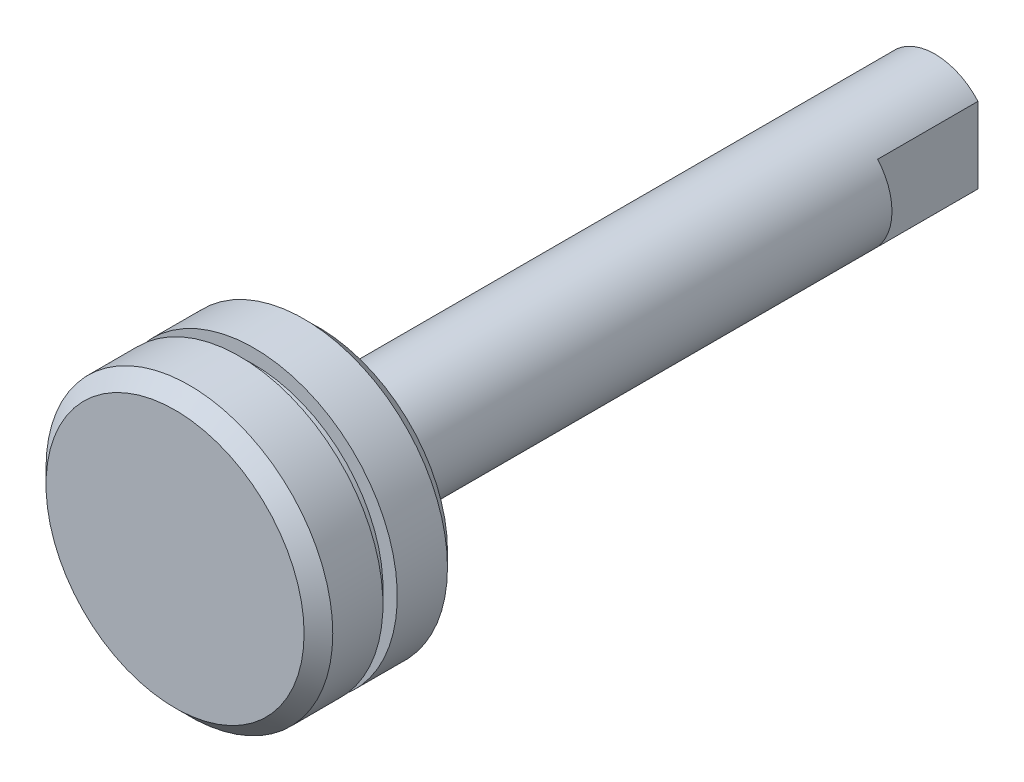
ISO-10303-21;
HEADER;
FILE_DESCRIPTION(('STEP AP214'),'2;1');
FILE_NAME('part.step','',(''),(''),'','','');
FILE_SCHEMA(('AUTOMOTIVE_DESIGN { 1 0 10303 214 1 1 1 1 }'));
ENDSEC;
DATA;
#1=APPLICATION_CONTEXT('core data for automotive mechanical design processes');
#2=APPLICATION_PROTOCOL_DEFINITION('international standard','automotive_design',2000,#1);
#3=PRODUCT_CONTEXT('',#1,'mechanical');
#4=PRODUCT('Part','Part','',(#3));
#5=PRODUCT_RELATED_PRODUCT_CATEGORY('part','',(#4));
#6=PRODUCT_DEFINITION_FORMATION('','',#4);
#7=PRODUCT_DEFINITION_CONTEXT('part definition',#1,'design');
#8=PRODUCT_DEFINITION('design','',#6,#7);
#9=PRODUCT_DEFINITION_SHAPE('','',#8);
#10=(LENGTH_UNIT() NAMED_UNIT(*) SI_UNIT(.MILLI.,.METRE.));
#11=(NAMED_UNIT(*) PLANE_ANGLE_UNIT() SI_UNIT($,.RADIAN.));
#12=(NAMED_UNIT(*) SI_UNIT($,.STERADIAN.) SOLID_ANGLE_UNIT());
#13=UNCERTAINTY_MEASURE_WITH_UNIT(LENGTH_MEASURE(1.E-05),#10,'distance_accuracy_value','');
#14=(GEOMETRIC_REPRESENTATION_CONTEXT(3) GLOBAL_UNCERTAINTY_ASSIGNED_CONTEXT((#13)) GLOBAL_UNIT_ASSIGNED_CONTEXT((#10,
#11,#12)) REPRESENTATION_CONTEXT('',''));
#15=CARTESIAN_POINT('',(0.,0.,0.));
#16=DIRECTION('',(0.,0.,1.));
#17=DIRECTION('',(1.,0.,0.));
#18=AXIS2_PLACEMENT_3D('',#15,#16,#17);
#19=CARTESIAN_POINT('',(0.,0.,43.));
#20=DIRECTION('',(0.,0.,1.));
#21=DIRECTION('',(1.,0.,0.));
#22=AXIS2_PLACEMENT_3D('',#19,#20,#21);
#23=PLANE('',#22);
#24=CARTESIAN_POINT('',(0.,0.,43.));
#25=DIRECTION('',(0.,0.,-1.));
#26=DIRECTION('',(-1.,0.,0.));
#27=AXIS2_PLACEMENT_3D('',#24,#25,#26);
#28=CIRCLE('',#27,7.5);
#29=CARTESIAN_POINT('',(-7.50000000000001,0.,43.));
#30=VERTEX_POINT('',#29);
#31=EDGE_CURVE('E102',#30,#30,#28,.T.);
#32=ORIENTED_EDGE('',*,*,#31,.F.);
#33=EDGE_LOOP('',(#32));
#34=FACE_BOUND('',#33,.T.);
#35=CARTESIAN_POINT('',(0.,0.,43.));
#36=DIRECTION('',(0.,0.,1.));
#37=DIRECTION('',(1.,0.,0.));
#38=AXIS2_PLACEMENT_3D('',#35,#36,#37);
#39=CIRCLE('',#38,9.);
#40=CARTESIAN_POINT('',(9.,0.,43.));
#41=VERTEX_POINT('',#40);
#42=EDGE_CURVE('E11',#41,#41,#39,.F.);
#43=ORIENTED_EDGE('',*,*,#42,.T.);
#44=EDGE_LOOP('',(#43));
#45=FACE_BOUND('',#44,.T.);
#46=ADVANCED_FACE('F40',(#34,#45),#23,.F.);
#47=CARTESIAN_POINT('',(0.,0.,53.));
#48=DIRECTION('',(0.,0.,-1.));
#49=DIRECTION('',(-1.,0.,0.));
#50=AXIS2_PLACEMENT_3D('',#47,#48,#49);
#51=CYLINDRICAL_SURFACE('',#50,10.);
#52=CARTESIAN_POINT('',(0.,0.,47.5));
#53=DIRECTION('',(0.,0.,-1.));
#54=DIRECTION('',(-1.,0.,0.));
#55=AXIS2_PLACEMENT_3D('',#52,#53,#54);
#56=CIRCLE('',#55,10.);
#57=CARTESIAN_POINT('',(-10.,0.,47.5));
#58=VERTEX_POINT('',#57);
#59=EDGE_CURVE('E108',#58,#58,#56,.T.);
#60=ORIENTED_EDGE('',*,*,#59,.T.);
#61=EDGE_LOOP('',(#60));
#62=FACE_BOUND('',#61,.T.);
#63=CARTESIAN_POINT('',(0.,0.,44.));
#64=DIRECTION('',(0.,0.,1.));
#65=DIRECTION('',(1.,0.,0.));
#66=AXIS2_PLACEMENT_3D('',#63,#64,#65);
#67=CIRCLE('',#66,10.);
#68=CARTESIAN_POINT('',(10.,0.,44.));
#69=VERTEX_POINT('',#68);
#70=EDGE_CURVE('E150',#69,#69,#67,.T.);
#71=ORIENTED_EDGE('',*,*,#70,.T.);
#72=EDGE_LOOP('',(#71));
#73=FACE_BOUND('',#72,.T.);
#74=ADVANCED_FACE('F176',(#62,#73),#51,.T.);
#75=CARTESIAN_POINT('',(0.,0.,44.));
#76=DIRECTION('',(0.,0.,1.));
#77=DIRECTION('',(1.,0.,0.));
#78=AXIS2_PLACEMENT_3D('',#75,#76,#77);
#79=CONICAL_SURFACE('',#78,10.,0.785398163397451);
#80=ORIENTED_EDGE('',*,*,#42,.F.);
#81=EDGE_LOOP('',(#80));
#82=FACE_BOUND('',#81,.T.);
#83=ORIENTED_EDGE('',*,*,#70,.F.);
#84=EDGE_LOOP('',(#83));
#85=FACE_BOUND('',#84,.T.);
#86=ADVANCED_FACE('F182',(#82,#85),#79,.T.);
#87=CARTESIAN_POINT('',(0.,10.,48.5));
#88=DIRECTION('',(0.,0.,1.));
#89=DIRECTION('',(1.,0.,0.));
#90=AXIS2_PLACEMENT_3D('',#87,#88,#89);
#91=PLANE('',#90);
#92=CARTESIAN_POINT('',(0.,0.,48.5));
#93=DIRECTION('',(0.,0.,-1.));
#94=DIRECTION('',(-1.,0.,0.));
#95=AXIS2_PLACEMENT_3D('',#92,#93,#94);
#96=CIRCLE('',#95,9.);
#97=CARTESIAN_POINT('',(-9.,0.,48.5));
#98=VERTEX_POINT('',#97);
#99=EDGE_CURVE('E114',#98,#98,#96,.T.);
#100=ORIENTED_EDGE('',*,*,#99,.F.);
#101=EDGE_LOOP('',(#100));
#102=FACE_BOUND('',#101,.T.);
#103=CARTESIAN_POINT('',(0.,0.,48.5));
#104=DIRECTION('',(0.,0.,-1.));
#105=DIRECTION('',(-1.,0.,0.));
#106=AXIS2_PLACEMENT_3D('',#103,#104,#105);
#107=CIRCLE('',#106,10.);
#108=CARTESIAN_POINT('',(-10.,0.,48.5));
#109=VERTEX_POINT('',#108);
#110=EDGE_CURVE('E99',#109,#109,#107,.T.);
#111=ORIENTED_EDGE('',*,*,#110,.T.);
#112=EDGE_LOOP('',(#111));
#113=FACE_BOUND('',#112,.T.);
#114=ADVANCED_FACE('F226',(#102,#113),#91,.F.);
#115=CARTESIAN_POINT('',(0.,0.,53.));
#116=DIRECTION('',(0.,0.,-1.));
#117=DIRECTION('',(-1.,0.,0.));
#118=AXIS2_PLACEMENT_3D('',#115,#116,#117);
#119=CYLINDRICAL_SURFACE('',#118,9.);
#120=CARTESIAN_POINT('',(0.,0.,47.5));
#121=DIRECTION('',(0.,0.,-1.));
#122=DIRECTION('',(-1.,0.,0.));
#123=AXIS2_PLACEMENT_3D('',#120,#121,#122);
#124=CIRCLE('',#123,9.);
#125=CARTESIAN_POINT('',(-9.,0.,47.5));
#126=VERTEX_POINT('',#125);
#127=EDGE_CURVE('E111',#126,#126,#124,.T.);
#128=ORIENTED_EDGE('',*,*,#127,.F.);
#129=EDGE_LOOP('',(#128));
#130=FACE_BOUND('',#129,.T.);
#131=ORIENTED_EDGE('',*,*,#99,.T.);
#132=EDGE_LOOP('',(#131));
#133=FACE_BOUND('',#132,.T.);
#134=ADVANCED_FACE('F170',(#130,#133),#119,.T.);
#135=CARTESIAN_POINT('',(0.,10.,47.5));
#136=DIRECTION('',(0.,0.,-1.));
#137=DIRECTION('',(-1.,0.,0.));
#138=AXIS2_PLACEMENT_3D('',#135,#136,#137);
#139=PLANE('',#138);
#140=ORIENTED_EDGE('',*,*,#59,.F.);
#141=EDGE_LOOP('',(#140));
#142=FACE_BOUND('',#141,.T.);
#143=ORIENTED_EDGE('',*,*,#127,.T.);
#144=EDGE_LOOP('',(#143));
#145=FACE_BOUND('',#144,.T.);
#146=ADVANCED_FACE('F165',(#142,#145),#139,.F.);
#147=CARTESIAN_POINT('',(0.,0.,53.));
#148=DIRECTION('',(0.,0.,1.));
#149=DIRECTION('',(1.,0.,0.));
#150=AXIS2_PLACEMENT_3D('',#147,#148,#149);
#151=PLANE('',#150);
#152=CARTESIAN_POINT('',(0.,0.,53.));
#153=DIRECTION('',(0.,0.,1.));
#154=DIRECTION('',(1.,0.,0.));
#155=AXIS2_PLACEMENT_3D('',#152,#153,#154);
#156=CIRCLE('',#155,9.);
#157=CARTESIAN_POINT('',(9.,0.,53.));
#158=VERTEX_POINT('',#157);
#159=EDGE_CURVE('E147',#158,#158,#156,.T.);
#160=ORIENTED_EDGE('',*,*,#159,.T.);
#161=EDGE_LOOP('',(#160));
#162=FACE_BOUND('',#161,.T.);
#163=ADVANCED_FACE('F160',(#162),#151,.T.);
#164=CARTESIAN_POINT('',(0.,0.,53.));
#165=DIRECTION('',(0.,0.,-1.));
#166=DIRECTION('',(-1.,0.,0.));
#167=AXIS2_PLACEMENT_3D('',#164,#165,#166);
#168=CONICAL_SURFACE('',#167,9.,0.785398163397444);
#169=CARTESIAN_POINT('',(0.,0.,52.));
#170=DIRECTION('',(0.,0.,1.));
#171=DIRECTION('',(1.,0.,0.));
#172=AXIS2_PLACEMENT_3D('',#169,#170,#171);
#173=CIRCLE('',#172,10.);
#174=CARTESIAN_POINT('',(10.,0.,52.));
#175=VERTEX_POINT('',#174);
#176=EDGE_CURVE('E48',#175,#175,#173,.F.);
#177=ORIENTED_EDGE('',*,*,#176,.F.);
#178=EDGE_LOOP('',(#177));
#179=FACE_BOUND('',#178,.T.);
#180=ORIENTED_EDGE('',*,*,#159,.F.);
#181=EDGE_LOOP('',(#180));
#182=FACE_BOUND('',#181,.T.);
#183=ADVANCED_FACE('F157',(#179,#182),#168,.T.);
#184=ORIENTED_EDGE('',*,*,#110,.F.);
#185=EDGE_LOOP('',(#184));
#186=FACE_BOUND('',#185,.T.);
#187=ORIENTED_EDGE('',*,*,#176,.T.);
#188=EDGE_LOOP('',(#187));
#189=FACE_BOUND('',#188,.T.);
#190=ADVANCED_FACE('F155',(#186,#189),#51,.T.);
#191=CARTESIAN_POINT('',(0.,0.,45.));
#192=DIRECTION('',(0.,0.,-1.));
#193=DIRECTION('',(-1.,0.,0.));
#194=AXIS2_PLACEMENT_3D('',#191,#192,#193);
#195=CYLINDRICAL_SURFACE('',#194,7.5);
#196=CARTESIAN_POINT('',(0.,0.,45.));
#197=DIRECTION('',(0.,0.,-1.));
#198=DIRECTION('',(-1.,0.,0.));
#199=AXIS2_PLACEMENT_3D('',#196,#197,#198);
#200=CIRCLE('',#199,7.5);
#201=CARTESIAN_POINT('',(-7.50000000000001,0.,45.));
#202=VERTEX_POINT('',#201);
#203=EDGE_CURVE('E96',#202,#202,#200,.T.);
#204=ORIENTED_EDGE('',*,*,#203,.F.);
#205=EDGE_LOOP('',(#204));
#206=FACE_BOUND('',#205,.T.);
#207=ORIENTED_EDGE('',*,*,#31,.T.);
#208=EDGE_LOOP('',(#207));
#209=FACE_BOUND('',#208,.T.);
#210=ADVANCED_FACE('F206',(#206,#209),#195,.F.);
#211=CARTESIAN_POINT('',(0.,0.,45.));
#212=DIRECTION('',(0.,0.,-1.));
#213=DIRECTION('',(-1.,0.,0.));
#214=AXIS2_PLACEMENT_3D('',#211,#212,#213);
#215=PLANE('',#214);
#216=CARTESIAN_POINT('',(0.,0.,45.));
#217=DIRECTION('',(0.,0.,-1.));
#218=DIRECTION('',(-1.,0.,0.));
#219=AXIS2_PLACEMENT_3D('',#216,#217,#218);
#220=CIRCLE('',#219,6.5);
#221=CARTESIAN_POINT('',(-6.50000000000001,0.,45.));
#222=VERTEX_POINT('',#221);
#223=EDGE_CURVE('E200',#222,#222,#220,.T.);
#224=ORIENTED_EDGE('',*,*,#223,.F.);
#225=EDGE_LOOP('',(#224));
#226=FACE_BOUND('',#225,.T.);
#227=ORIENTED_EDGE('',*,*,#203,.T.);
#228=EDGE_LOOP('',(#227));
#229=FACE_BOUND('',#228,.T.);
#230=ADVANCED_FACE('F208',(#226,#229),#215,.T.);
#231=CARTESIAN_POINT('',(0.,0.,45.));
#232=DIRECTION('',(0.,0.,-1.));
#233=DIRECTION('',(-1.,0.,0.));
#234=AXIS2_PLACEMENT_3D('',#231,#232,#233);
#235=CYLINDRICAL_SURFACE('',#234,6.5);
#236=ORIENTED_EDGE('',*,*,#223,.T.);
#237=EDGE_LOOP('',(#236));
#238=FACE_BOUND('',#237,.T.);
#239=CARTESIAN_POINT('',(0.,0.,43.));
#240=DIRECTION('',(0.,0.,-1.));
#241=DIRECTION('',(-1.,0.,0.));
#242=AXIS2_PLACEMENT_3D('',#239,#240,#241);
#243=CIRCLE('',#242,6.5);
#244=CARTESIAN_POINT('',(-6.50000000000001,0.,43.));
#245=VERTEX_POINT('',#244);
#246=EDGE_CURVE('E198',#245,#245,#243,.T.);
#247=ORIENTED_EDGE('',*,*,#246,.F.);
#248=EDGE_LOOP('',(#247));
#249=FACE_BOUND('',#248,.T.);
#250=ADVANCED_FACE('F89',(#238,#249),#235,.T.);
#251=CARTESIAN_POINT('',(0.,0.,19.));
#252=DIRECTION('',(0.,0.,-1.));
#253=DIRECTION('',(-1.,0.,0.));
#254=AXIS2_PLACEMENT_3D('',#251,#252,#253);
#255=CONICAL_SURFACE('',#254,2.1,1.02974425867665);
#256=CARTESIAN_POINT('',(0.,0.,20.2618072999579));
#257=VERTEX_POINT('',#256);
#258=VERTEX_LOOP('',#257);
#259=FACE_BOUND('',#258,.T.);
#260=CARTESIAN_POINT('',(0.,0.,19.));
#261=DIRECTION('',(0.,0.,-1.));
#262=DIRECTION('',(-1.,0.,0.));
#263=AXIS2_PLACEMENT_3D('',#260,#261,#262);
#264=CIRCLE('',#263,2.1);
#265=CARTESIAN_POINT('',(-2.1,0.,19.));
#266=VERTEX_POINT('',#265);
#267=EDGE_CURVE('E93',#266,#266,#264,.T.);
#268=ORIENTED_EDGE('',*,*,#267,.T.);
#269=EDGE_LOOP('',(#268));
#270=FACE_BOUND('',#269,.T.);
#271=ADVANCED_FACE('F85',(#259,#270),#255,.F.);
#272=CARTESIAN_POINT('',(0.,0.,0.));
#273=DIRECTION('',(0.,0.,-1.));
#274=DIRECTION('',(-1.,0.,0.));
#275=AXIS2_PLACEMENT_3D('',#272,#273,#274);
#276=CYLINDRICAL_SURFACE('',#275,2.1);
#277=ORIENTED_EDGE('',*,*,#267,.F.);
#278=EDGE_LOOP('',(#277));
#279=FACE_BOUND('',#278,.T.);
#280=CARTESIAN_POINT('',(0.,0.,0.));
#281=DIRECTION('',(0.,0.,-1.));
#282=DIRECTION('',(-1.,0.,0.));
#283=AXIS2_PLACEMENT_3D('',#280,#281,#282);
#284=CIRCLE('',#283,2.1);
#285=CARTESIAN_POINT('',(-2.1,0.,0.));
#286=VERTEX_POINT('',#285);
#287=EDGE_CURVE('E95',#286,#286,#284,.T.);
#288=ORIENTED_EDGE('',*,*,#287,.T.);
#289=EDGE_LOOP('',(#288));
#290=FACE_BOUND('',#289,.T.);
#291=ADVANCED_FACE('F88',(#279,#290),#276,.F.);
#292=CARTESIAN_POINT('',(-3.,-3.90950226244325,7.));
#293=DIRECTION('',(0.,0.,-1.));
#294=DIRECTION('',(-1.,0.,0.));
#295=AXIS2_PLACEMENT_3D('',#292,#293,#294);
#296=PLANE('',#295);
#297=CARTESIAN_POINT('',(0.,0.,7.));
#298=DIRECTION('',(0.,0.,-1.));
#299=DIRECTION('',(-1.,0.,0.));
#300=AXIS2_PLACEMENT_3D('',#297,#298,#299);
#301=CIRCLE('',#300,4.);
#302=CARTESIAN_POINT('',(-3.,-2.64575131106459,7.));
#303=VERTEX_POINT('',#302);
#304=CARTESIAN_POINT('',(-3.,2.64575131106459,7.));
#305=VERTEX_POINT('',#304);
#306=EDGE_CURVE('E140',#303,#305,#301,.T.);
#307=ORIENTED_EDGE('',*,*,#306,.T.);
#308=DIRECTION('',(0.,-1.,0.));
#309=VECTOR('',#308,1.);
#310=CARTESIAN_POINT('',(-3.,4.10256410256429,7.));
#311=LINE('',#310,#309);
#312=EDGE_CURVE('E123',#305,#303,#311,.T.);
#313=ORIENTED_EDGE('',*,*,#312,.T.);
#314=EDGE_LOOP('',(#307,#313));
#315=FACE_BOUND('',#314,.T.);
#316=ADVANCED_FACE('F222',(#315),#296,.T.);
#317=CARTESIAN_POINT('',(-3.,4.10256410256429,7.));
#318=DIRECTION('',(1.,0.,0.));
#319=DIRECTION('',(0.,1.,0.));
#320=AXIS2_PLACEMENT_3D('',#317,#318,#319);
#321=PLANE('',#320);
#322=ORIENTED_EDGE('',*,*,#312,.F.);
#323=DIRECTION('',(0.,0.,-1.));
#324=VECTOR('',#323,1.);
#325=CARTESIAN_POINT('',(-3.,2.64575131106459,43.));
#326=LINE('',#325,#324);
#327=CARTESIAN_POINT('',(-3.,2.64575131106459,0.));
#328=VERTEX_POINT('',#327);
#329=EDGE_CURVE('E126',#328,#305,#326,.F.);
#330=ORIENTED_EDGE('',*,*,#329,.F.);
#331=DIRECTION('',(0.,1.,0.));
#332=VECTOR('',#331,1.);
#333=CARTESIAN_POINT('',(-3.,0.,0.));
#334=LINE('',#333,#332);
#335=CARTESIAN_POINT('',(-3.,-2.64575131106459,0.));
#336=VERTEX_POINT('',#335);
#337=EDGE_CURVE('E137',#336,#328,#334,.T.);
#338=ORIENTED_EDGE('',*,*,#337,.F.);
#339=DIRECTION('',(0.,0.,-1.));
#340=VECTOR('',#339,1.);
#341=CARTESIAN_POINT('',(-3.,-2.64575131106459,43.));
#342=LINE('',#341,#340);
#343=EDGE_CURVE('E128',#303,#336,#342,.T.);
#344=ORIENTED_EDGE('',*,*,#343,.F.);
#345=EDGE_LOOP('',(#322,#330,#338,#344));
#346=FACE_BOUND('',#345,.T.);
#347=ADVANCED_FACE('F242',(#346),#321,.F.);
#348=CARTESIAN_POINT('',(0.,0.,0.));
#349=DIRECTION('',(0.,0.,1.));
#350=DIRECTION('',(1.,0.,0.));
#351=AXIS2_PLACEMENT_3D('',#348,#349,#350);
#352=PLANE('',#351);
#353=ORIENTED_EDGE('',*,*,#287,.F.);
#354=EDGE_LOOP('',(#353));
#355=FACE_BOUND('',#354,.T.);
#356=CARTESIAN_POINT('',(0.,0.,0.));
#357=DIRECTION('',(0.,0.,1.));
#358=DIRECTION('',(1.,0.,0.));
#359=AXIS2_PLACEMENT_3D('',#356,#357,#358);
#360=CIRCLE('',#359,4.);
#361=CARTESIAN_POINT('',(3.,2.64575131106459,0.));
#362=VERTEX_POINT('',#361);
#363=EDGE_CURVE('E63',#362,#328,#360,.T.);
#364=ORIENTED_EDGE('',*,*,#363,.F.);
#365=DIRECTION('',(0.,-1.,0.));
#366=VECTOR('',#365,1.);
#367=CARTESIAN_POINT('',(3.,0.,0.));
#368=LINE('',#367,#366);
#369=CARTESIAN_POINT('',(3.,-2.64575131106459,0.));
#370=VERTEX_POINT('',#369);
#371=EDGE_CURVE('E142',#362,#370,#368,.T.);
#372=ORIENTED_EDGE('',*,*,#371,.T.);
#373=EDGE_CURVE('E131',#336,#370,#360,.T.);
#374=ORIENTED_EDGE('',*,*,#373,.F.);
#375=ORIENTED_EDGE('',*,*,#337,.T.);
#376=EDGE_LOOP('',(#364,#372,#374,#375));
#377=FACE_BOUND('',#376,.T.);
#378=ADVANCED_FACE('F240',(#355,#377),#352,.F.);
#379=CARTESIAN_POINT('',(3.,4.10256410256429,7.));
#380=DIRECTION('',(-1.,0.,0.));
#381=DIRECTION('',(0.,-1.,0.));
#382=AXIS2_PLACEMENT_3D('',#379,#380,#381);
#383=PLANE('',#382);
#384=DIRECTION('',(0.,1.,0.));
#385=VECTOR('',#384,1.);
#386=CARTESIAN_POINT('',(3.,4.10256410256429,7.));
#387=LINE('',#386,#385);
#388=CARTESIAN_POINT('',(3.,-2.64575131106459,7.));
#389=VERTEX_POINT('',#388);
#390=CARTESIAN_POINT('',(3.,2.64575131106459,7.));
#391=VERTEX_POINT('',#390);
#392=EDGE_CURVE('E117',#389,#391,#387,.T.);
#393=ORIENTED_EDGE('',*,*,#392,.F.);
#394=DIRECTION('',(0.,0.,-1.));
#395=VECTOR('',#394,1.);
#396=CARTESIAN_POINT('',(3.,-2.64575131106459,43.));
#397=LINE('',#396,#395);
#398=EDGE_CURVE('E55',#370,#389,#397,.F.);
#399=ORIENTED_EDGE('',*,*,#398,.F.);
#400=ORIENTED_EDGE('',*,*,#371,.F.);
#401=DIRECTION('',(0.,0.,-1.));
#402=VECTOR('',#401,1.);
#403=CARTESIAN_POINT('',(3.,2.64575131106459,43.));
#404=LINE('',#403,#402);
#405=EDGE_CURVE('E121',#391,#362,#404,.T.);
#406=ORIENTED_EDGE('',*,*,#405,.F.);
#407=EDGE_LOOP('',(#393,#399,#400,#406));
#408=FACE_BOUND('',#407,.T.);
#409=ADVANCED_FACE('F236',(#408),#383,.F.);
#410=CARTESIAN_POINT('',(3.,-4.16691804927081,7.));
#411=DIRECTION('',(0.,0.,1.));
#412=DIRECTION('',(1.,0.,0.));
#413=AXIS2_PLACEMENT_3D('',#410,#411,#412);
#414=PLANE('',#413);
#415=ORIENTED_EDGE('',*,*,#392,.T.);
#416=CARTESIAN_POINT('',(0.,0.,7.));
#417=DIRECTION('',(0.,0.,1.));
#418=DIRECTION('',(1.,0.,0.));
#419=AXIS2_PLACEMENT_3D('',#416,#417,#418);
#420=CIRCLE('',#419,4.);
#421=EDGE_CURVE('E144',#389,#391,#420,.T.);
#422=ORIENTED_EDGE('',*,*,#421,.F.);
#423=EDGE_LOOP('',(#415,#422));
#424=FACE_BOUND('',#423,.T.);
#425=ADVANCED_FACE('F192',(#424),#414,.F.);
#426=CARTESIAN_POINT('',(0.,0.,43.));
#427=DIRECTION('',(0.,0.,-1.));
#428=DIRECTION('',(-1.,0.,0.));
#429=AXIS2_PLACEMENT_3D('',#426,#427,#428);
#430=CYLINDRICAL_SURFACE('',#429,4.);
#431=CARTESIAN_POINT('',(0.,0.,43.));
#432=DIRECTION('',(0.,0.,1.));
#433=DIRECTION('',(1.,0.,0.));
#434=AXIS2_PLACEMENT_3D('',#431,#432,#433);
#435=CIRCLE('',#434,4.);
#436=CARTESIAN_POINT('',(4.,0.,43.));
#437=VERTEX_POINT('',#436);
#438=EDGE_CURVE('E134',#437,#437,#435,.T.);
#439=ORIENTED_EDGE('',*,*,#438,.F.);
#440=EDGE_LOOP('',(#439));
#441=FACE_BOUND('',#440,.T.);
#442=ORIENTED_EDGE('',*,*,#421,.T.);
#443=ORIENTED_EDGE('',*,*,#405,.T.);
#444=ORIENTED_EDGE('',*,*,#363,.T.);
#445=ORIENTED_EDGE('',*,*,#329,.T.);
#446=ORIENTED_EDGE('',*,*,#306,.F.);
#447=ORIENTED_EDGE('',*,*,#343,.T.);
#448=ORIENTED_EDGE('',*,*,#373,.T.);
#449=ORIENTED_EDGE('',*,*,#398,.T.);
#450=EDGE_LOOP('',(#442,#443,#444,#445,#446,#447,#448,#449));
#451=FACE_BOUND('',#450,.T.);
#452=ADVANCED_FACE('F42',(#441,#451),#430,.T.);
#453=ORIENTED_EDGE('',*,*,#438,.T.);
#454=EDGE_LOOP('',(#453));
#455=FACE_BOUND('',#454,.T.);
#456=ORIENTED_EDGE('',*,*,#246,.T.);
#457=EDGE_LOOP('',(#456));
#458=FACE_BOUND('',#457,.T.);
#459=ADVANCED_FACE('F178',(#455,#458),#23,.F.);
#460=CLOSED_SHELL('',(#46,#74,#86,#114,#134,#146,#163,#183,#190,#210,#230,#250,#271,#291,#316,
#347,#378,#409,#425,#452,#459));
#461=MANIFOLD_SOLID_BREP('B2',#460);
#462=ADVANCED_BREP_SHAPE_REPRESENTATION('',(#18,#461),#14);
#463=SHAPE_DEFINITION_REPRESENTATION(#9,#462);
ENDSEC;
END-ISO-10303-21;
